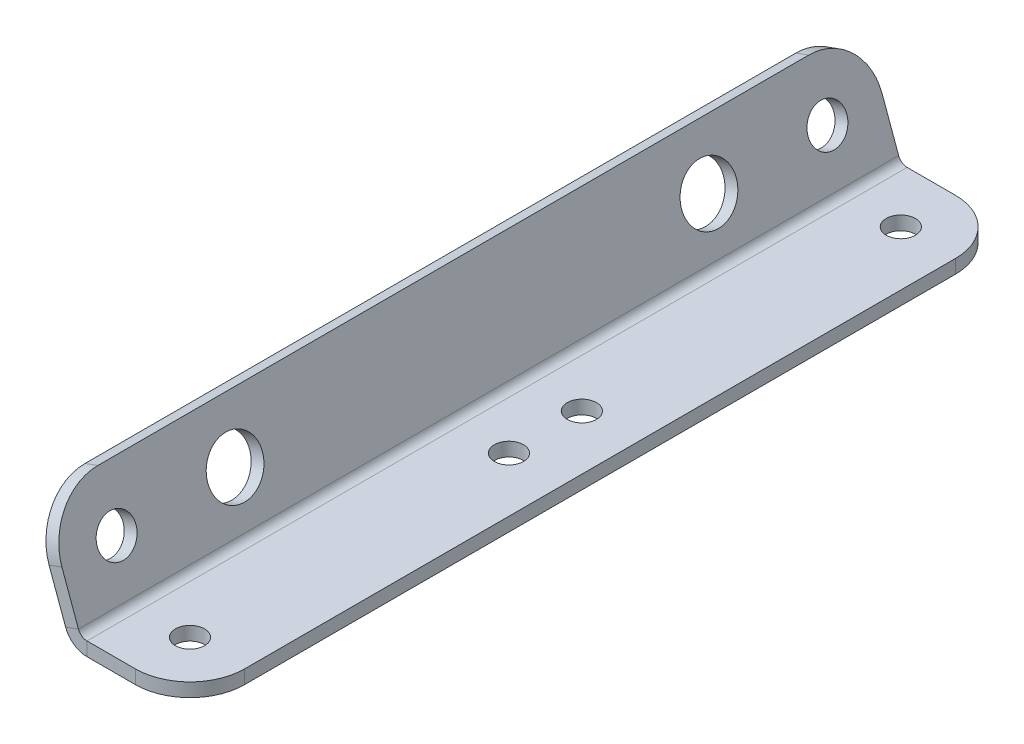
ISO-10303-21;
HEADER;
FILE_DESCRIPTION(('STEP AP214'),'2;1');
FILE_NAME('part.step','',(''),(''),'','','');
FILE_SCHEMA(('AUTOMOTIVE_DESIGN { 1 0 10303 214 1 1 1 1 }'));
ENDSEC;
DATA;
#1=APPLICATION_CONTEXT('core data for automotive mechanical design processes');
#2=APPLICATION_PROTOCOL_DEFINITION('international standard','automotive_design',2000,#1);
#3=PRODUCT_CONTEXT('',#1,'mechanical');
#4=PRODUCT('Part','Part','',(#3));
#5=PRODUCT_RELATED_PRODUCT_CATEGORY('part','',(#4));
#6=PRODUCT_DEFINITION_FORMATION('','',#4);
#7=PRODUCT_DEFINITION_CONTEXT('part definition',#1,'design');
#8=PRODUCT_DEFINITION('design','',#6,#7);
#9=PRODUCT_DEFINITION_SHAPE('','',#8);
#10=(LENGTH_UNIT() NAMED_UNIT(*) SI_UNIT(.MILLI.,.METRE.));
#11=(NAMED_UNIT(*) PLANE_ANGLE_UNIT() SI_UNIT($,.RADIAN.));
#12=(NAMED_UNIT(*) SI_UNIT($,.STERADIAN.) SOLID_ANGLE_UNIT());
#13=UNCERTAINTY_MEASURE_WITH_UNIT(LENGTH_MEASURE(1.E-05),#10,'distance_accuracy_value','');
#14=(GEOMETRIC_REPRESENTATION_CONTEXT(3) GLOBAL_UNCERTAINTY_ASSIGNED_CONTEXT((#13)) GLOBAL_UNIT_ASSIGNED_CONTEXT((#10,
#11,#12)) REPRESENTATION_CONTEXT('',''));
#15=CARTESIAN_POINT('',(0.,0.,0.));
#16=DIRECTION('',(0.,0.,1.));
#17=DIRECTION('',(1.,0.,0.));
#18=AXIS2_PLACEMENT_3D('',#15,#16,#17);
#19=CARTESIAN_POINT('',(340.945249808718,124.09392244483,-90.));
#20=DIRECTION('',(0.,0.,1.));
#21=DIRECTION('',(0.342020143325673,-0.939692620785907,0.));
#22=AXIS2_PLACEMENT_3D('',#19,#20,#21);
#23=PLANE('',#22);
#24=DIRECTION('',(-0.342020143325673,0.939692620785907,0.));
#25=VECTOR('',#24,1.);
#26=CARTESIAN_POINT('',(-2.81907786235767,-1.02606042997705,-90.));
#27=LINE('',#26,#25);
#28=CARTESIAN_POINT('',(-3.29804802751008,0.289899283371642,-90.));
#29=VERTEX_POINT('',#28);
#30=CARTESIAN_POINT('',(-6.92331958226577,10.2502510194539,-90.));
#31=VERTEX_POINT('',#30);
#32=EDGE_CURVE('E183',#29,#31,#27,.T.);
#33=ORIENTED_EDGE('',*,*,#32,.T.);
#34=DIRECTION('',(-0.939692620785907,-0.342020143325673,0.));
#35=VECTOR('',#34,1.);
#36=CARTESIAN_POINT('',(336.84100808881,135.370233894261,-90.0000000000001));
#37=LINE('',#36,#35);
#38=CARTESIAN_POINT('',(-4.10424171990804,11.2763114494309,-90.));
#39=VERTEX_POINT('',#38);
#40=EDGE_CURVE('E219',#31,#39,#37,.F.);
#41=ORIENTED_EDGE('',*,*,#40,.T.);
#42=DIRECTION('',(-0.342020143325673,0.939692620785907,0.));
#43=VECTOR('',#42,1.);
#44=CARTESIAN_POINT('',(0.,0.,-90.));
#45=LINE('',#44,#43);
#46=CARTESIAN_POINT('',(-0.478970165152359,1.31595971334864,-90.));
#47=VERTEX_POINT('',#46);
#48=EDGE_CURVE('E195',#47,#39,#45,.T.);
#49=ORIENTED_EDGE('',*,*,#48,.F.);
#50=DIRECTION('',(-0.939692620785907,-0.342020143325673,0.));
#51=VECTOR('',#50,1.);
#52=CARTESIAN_POINT('',(340.466279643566,125.409882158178,-90.));
#53=LINE('',#52,#51);
#54=EDGE_CURVE('E141',#47,#29,#53,.T.);
#55=ORIENTED_EDGE('',*,*,#54,.T.);
#56=EDGE_LOOP('',(#33,#41,#49,#55));
#57=FACE_BOUND('',#56,.T.);
#58=ADVANCED_FACE('F29',(#57),#23,.F.);
#59=CARTESIAN_POINT('',(332.736766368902,146.646545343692,90.));
#60=DIRECTION('',(-0.342020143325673,0.939692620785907,0.));
#61=DIRECTION('',(-0.939692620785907,-0.342020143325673,0.));
#62=AXIS2_PLACEMENT_3D('',#59,#60,#61);
#63=PLANE('',#62);
#64=DIRECTION('',(0.,0.,-1.));
#65=VECTOR('',#64,1.);
#66=CARTESIAN_POINT('',(-8.20848343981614,22.5526228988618,90.));
#67=LINE('',#66,#65);
#68=CARTESIAN_POINT('',(-8.20848343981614,22.5526228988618,78.));
#69=VERTEX_POINT('',#68);
#70=CARTESIAN_POINT('',(-8.20848343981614,22.5526228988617,-77.9999999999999));
#71=VERTEX_POINT('',#70);
#72=EDGE_CURVE('E198',#69,#71,#67,.T.);
#73=ORIENTED_EDGE('',*,*,#72,.T.);
#74=DIRECTION('',(-0.939692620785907,-0.342020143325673,0.));
#75=VECTOR('',#74,1.);
#76=CARTESIAN_POINT('',(332.736766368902,146.646545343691,-78.0000000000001));
#77=LINE('',#76,#75);
#78=CARTESIAN_POINT('',(-11.0275613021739,21.5265624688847,-77.9999999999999));
#79=VERTEX_POINT('',#78);
#80=EDGE_CURVE('E212',#71,#79,#77,.T.);
#81=ORIENTED_EDGE('',*,*,#80,.T.);
#82=DIRECTION('',(0.,0.,-1.));
#83=VECTOR('',#82,1.);
#84=CARTESIAN_POINT('',(-11.0275613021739,21.5265624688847,90.));
#85=LINE('',#84,#83);
#86=CARTESIAN_POINT('',(-11.0275613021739,21.5265624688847,78.));
#87=VERTEX_POINT('',#86);
#88=EDGE_CURVE('E189',#87,#79,#85,.T.);
#89=ORIENTED_EDGE('',*,*,#88,.F.);
#90=DIRECTION('',(-0.939692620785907,-0.342020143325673,0.));
#91=VECTOR('',#90,1.);
#92=CARTESIAN_POINT('',(332.736766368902,146.646545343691,78.));
#93=LINE('',#92,#91);
#94=EDGE_CURVE('E210',#87,#69,#93,.F.);
#95=ORIENTED_EDGE('',*,*,#94,.T.);
#96=EDGE_LOOP('',(#73,#81,#89,#95));
#97=FACE_BOUND('',#96,.T.);
#98=ADVANCED_FACE('F323',(#97),#63,.T.);
#99=CARTESIAN_POINT('',(340.945249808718,124.09392244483,90.));
#100=DIRECTION('',(0.,0.,1.));
#101=DIRECTION('',(0.342020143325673,-0.939692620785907,0.));
#102=AXIS2_PLACEMENT_3D('',#99,#100,#101);
#103=PLANE('',#102);
#104=DIRECTION('',(-0.342020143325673,0.939692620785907,0.));
#105=VECTOR('',#104,1.);
#106=CARTESIAN_POINT('',(0.,0.,90.));
#107=LINE('',#106,#105);
#108=CARTESIAN_POINT('',(-0.478970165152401,1.31595971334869,90.));
#109=VERTEX_POINT('',#108);
#110=CARTESIAN_POINT('',(-4.10424171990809,11.2763114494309,90.));
#111=VERTEX_POINT('',#110);
#112=EDGE_CURVE('E201',#109,#111,#107,.T.);
#113=ORIENTED_EDGE('',*,*,#112,.T.);
#114=DIRECTION('',(-0.939692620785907,-0.342020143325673,0.));
#115=VECTOR('',#114,1.);
#116=CARTESIAN_POINT('',(336.84100808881,135.370233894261,90.));
#117=LINE('',#116,#115);
#118=CARTESIAN_POINT('',(-6.92331958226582,10.2502510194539,90.));
#119=VERTEX_POINT('',#118);
#120=EDGE_CURVE('E11',#111,#119,#117,.T.);
#121=ORIENTED_EDGE('',*,*,#120,.T.);
#122=DIRECTION('',(-0.342020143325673,0.939692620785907,0.));
#123=VECTOR('',#122,1.);
#124=CARTESIAN_POINT('',(-2.81907786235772,-1.02606042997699,90.));
#125=LINE('',#124,#123);
#126=CARTESIAN_POINT('',(-3.29804802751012,0.289899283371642,90.));
#127=VERTEX_POINT('',#126);
#128=EDGE_CURVE('E186',#127,#119,#125,.T.);
#129=ORIENTED_EDGE('',*,*,#128,.F.);
#130=DIRECTION('',(-0.939692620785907,-0.342020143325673,0.));
#131=VECTOR('',#130,1.);
#132=CARTESIAN_POINT('',(340.466279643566,125.409882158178,90.));
#133=LINE('',#132,#131);
#134=EDGE_CURVE('E207',#109,#127,#133,.T.);
#135=ORIENTED_EDGE('',*,*,#134,.F.);
#136=EDGE_LOOP('',(#113,#121,#129,#135));
#137=FACE_BOUND('',#136,.T.);
#138=ADVANCED_FACE('F328',(#137),#103,.T.);
#139=CARTESIAN_POINT('',(0.,0.,90.));
#140=DIRECTION('',(-0.939692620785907,-0.342020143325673,0.));
#141=DIRECTION('',(0.342020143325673,-0.939692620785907,0.));
#142=AXIS2_PLACEMENT_3D('',#139,#140,#141);
#143=PLANE('',#142);
#144=CARTESIAN_POINT('',(-4.10424171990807,11.2763114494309,-52.));
#145=DIRECTION('',(0.939692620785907,0.342020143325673,0.));
#146=DIRECTION('',(0.342020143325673,-0.939692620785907,0.));
#147=AXIS2_PLACEMENT_3D('',#144,#145,#146);
#148=CIRCLE('',#147,6.);
#149=CARTESIAN_POINT('',(-2.05212085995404,5.63815572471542,-52.));
#150=VERTEX_POINT('',#149);
#151=EDGE_CURVE('E155',#150,#150,#148,.T.);
#152=ORIENTED_EDGE('',*,*,#151,.F.);
#153=EDGE_LOOP('',(#152));
#154=FACE_BOUND('',#153,.T.);
#155=CARTESIAN_POINT('',(-4.10424171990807,11.2763114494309,-78.));
#156=DIRECTION('',(0.939692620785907,0.342020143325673,0.));
#157=DIRECTION('',(0.342020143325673,-0.939692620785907,0.));
#158=AXIS2_PLACEMENT_3D('',#155,#156,#157);
#159=CIRCLE('',#158,4.25);
#160=CARTESIAN_POINT('',(-2.65065611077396,7.28261781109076,-78.));
#161=VERTEX_POINT('',#160);
#162=EDGE_CURVE('E165',#161,#161,#159,.T.);
#163=ORIENTED_EDGE('',*,*,#162,.F.);
#164=EDGE_LOOP('',(#163));
#165=FACE_BOUND('',#164,.T.);
#166=CARTESIAN_POINT('',(-4.10424171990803,11.2763114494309,52.));
#167=DIRECTION('',(0.939692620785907,0.342020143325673,0.));
#168=DIRECTION('',(-0.342020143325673,0.939692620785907,0.));
#169=AXIS2_PLACEMENT_3D('',#166,#167,#168);
#170=CIRCLE('',#169,6.);
#171=CARTESIAN_POINT('',(-6.15636257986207,16.9144671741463,52.));
#172=VERTEX_POINT('',#171);
#173=EDGE_CURVE('E171',#172,#172,#170,.T.);
#174=ORIENTED_EDGE('',*,*,#173,.F.);
#175=EDGE_LOOP('',(#174));
#176=FACE_BOUND('',#175,.T.);
#177=CARTESIAN_POINT('',(-4.10424171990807,11.2763114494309,78.));
#178=DIRECTION('',(0.939692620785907,0.342020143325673,0.));
#179=DIRECTION('',(-0.342020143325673,0.939692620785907,0.));
#180=AXIS2_PLACEMENT_3D('',#177,#178,#179);
#181=CIRCLE('',#180,4.25);
#182=CARTESIAN_POINT('',(-5.55782732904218,15.270005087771,78.));
#183=VERTEX_POINT('',#182);
#184=EDGE_CURVE('E177',#183,#183,#181,.T.);
#185=ORIENTED_EDGE('',*,*,#184,.F.);
#186=EDGE_LOOP('',(#185));
#187=FACE_BOUND('',#186,.T.);
#188=ORIENTED_EDGE('',*,*,#48,.T.);
#189=CARTESIAN_POINT('',(-4.10424171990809,11.2763114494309,-78.));
#190=DIRECTION('',(-0.939692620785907,-0.342020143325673,0.));
#191=DIRECTION('',(0.342020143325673,-0.939692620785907,0.));
#192=AXIS2_PLACEMENT_3D('',#189,#190,#191);
#193=CIRCLE('',#192,12.);
#194=EDGE_CURVE('E223',#39,#71,#193,.F.);
#195=ORIENTED_EDGE('',*,*,#194,.T.);
#196=ORIENTED_EDGE('',*,*,#72,.F.);
#197=CARTESIAN_POINT('',(-4.10424171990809,11.2763114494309,78.));
#198=DIRECTION('',(-0.939692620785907,-0.342020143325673,0.));
#199=DIRECTION('',(0.342020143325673,-0.939692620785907,0.));
#200=AXIS2_PLACEMENT_3D('',#197,#198,#199);
#201=CIRCLE('',#200,12.);
#202=EDGE_CURVE('E221',#69,#111,#201,.F.);
#203=ORIENTED_EDGE('',*,*,#202,.T.);
#204=ORIENTED_EDGE('',*,*,#112,.F.);
#205=DIRECTION('',(0.,0.,-1.));
#206=VECTOR('',#205,1.);
#207=CARTESIAN_POINT('',(-0.478970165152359,1.31595971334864,-90.));
#208=LINE('',#207,#206);
#209=EDGE_CURVE('E204',#109,#47,#208,.T.);
#210=ORIENTED_EDGE('',*,*,#209,.T.);
#211=EDGE_LOOP('',(#188,#195,#196,#203,#204,#210));
#212=FACE_BOUND('',#211,.T.);
#213=ADVANCED_FACE('F339',(#154,#165,#176,#187,#212),#143,.F.);
#214=CARTESIAN_POINT('',(-2.81907786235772,-1.02606042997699,90.));
#215=DIRECTION('',(-0.939692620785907,-0.342020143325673,0.));
#216=DIRECTION('',(0.342020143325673,-0.939692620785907,0.));
#217=AXIS2_PLACEMENT_3D('',#214,#215,#216);
#218=PLANE('',#217);
#219=CARTESIAN_POINT('',(-6.92331958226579,10.2502510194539,-52.));
#220=DIRECTION('',(0.939692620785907,0.342020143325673,0.));
#221=DIRECTION('',(0.342020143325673,-0.939692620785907,0.));
#222=AXIS2_PLACEMENT_3D('',#219,#220,#221);
#223=CIRCLE('',#222,6.);
#224=CARTESIAN_POINT('',(-4.87119872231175,4.61209529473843,-52.));
#225=VERTEX_POINT('',#224);
#226=EDGE_CURVE('E158',#225,#225,#223,.T.);
#227=ORIENTED_EDGE('',*,*,#226,.T.);
#228=EDGE_LOOP('',(#227));
#229=FACE_BOUND('',#228,.T.);
#230=CARTESIAN_POINT('',(-6.92331958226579,10.2502510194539,-78.));
#231=DIRECTION('',(0.939692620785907,0.342020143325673,0.));
#232=DIRECTION('',(0.342020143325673,-0.939692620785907,0.));
#233=AXIS2_PLACEMENT_3D('',#230,#231,#232);
#234=CIRCLE('',#233,4.25);
#235=CARTESIAN_POINT('',(-5.46973397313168,6.25655738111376,-78.));
#236=VERTEX_POINT('',#235);
#237=EDGE_CURVE('E168',#236,#236,#234,.T.);
#238=ORIENTED_EDGE('',*,*,#237,.T.);
#239=EDGE_LOOP('',(#238));
#240=FACE_BOUND('',#239,.T.);
#241=CARTESIAN_POINT('',(-6.92331958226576,10.2502510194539,52.));
#242=DIRECTION('',(0.939692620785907,0.342020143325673,0.));
#243=DIRECTION('',(-0.342020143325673,0.939692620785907,0.));
#244=AXIS2_PLACEMENT_3D('',#241,#242,#243);
#245=CIRCLE('',#244,6.);
#246=CARTESIAN_POINT('',(-8.9754404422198,15.8884067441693,52.));
#247=VERTEX_POINT('',#246);
#248=EDGE_CURVE('E174',#247,#247,#245,.T.);
#249=ORIENTED_EDGE('',*,*,#248,.T.);
#250=EDGE_LOOP('',(#249));
#251=FACE_BOUND('',#250,.T.);
#252=CARTESIAN_POINT('',(-6.9233195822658,10.2502510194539,78.));
#253=DIRECTION('',(0.939692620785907,0.342020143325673,0.));
#254=DIRECTION('',(-0.342020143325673,0.939692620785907,0.));
#255=AXIS2_PLACEMENT_3D('',#252,#253,#254);
#256=CIRCLE('',#255,4.25);
#257=CARTESIAN_POINT('',(-8.37690519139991,14.243944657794,78.));
#258=VERTEX_POINT('',#257);
#259=EDGE_CURVE('E180',#258,#258,#256,.T.);
#260=ORIENTED_EDGE('',*,*,#259,.T.);
#261=EDGE_LOOP('',(#260));
#262=FACE_BOUND('',#261,.T.);
#263=ORIENTED_EDGE('',*,*,#88,.T.);
#264=CARTESIAN_POINT('',(-6.92331958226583,10.2502510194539,-78.));
#265=DIRECTION('',(-0.939692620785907,-0.342020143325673,0.));
#266=DIRECTION('',(0.342020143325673,-0.939692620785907,0.));
#267=AXIS2_PLACEMENT_3D('',#264,#265,#266);
#268=CIRCLE('',#267,12.);
#269=EDGE_CURVE('E217',#79,#31,#268,.T.);
#270=ORIENTED_EDGE('',*,*,#269,.T.);
#271=ORIENTED_EDGE('',*,*,#32,.F.);
#272=DIRECTION('',(0.,0.,-1.));
#273=VECTOR('',#272,1.);
#274=CARTESIAN_POINT('',(-3.29804802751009,0.289899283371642,-90.));
#275=LINE('',#274,#273);
#276=EDGE_CURVE('E192',#127,#29,#275,.T.);
#277=ORIENTED_EDGE('',*,*,#276,.F.);
#278=ORIENTED_EDGE('',*,*,#128,.T.);
#279=CARTESIAN_POINT('',(-6.92331958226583,10.2502510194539,78.));
#280=DIRECTION('',(-0.939692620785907,-0.342020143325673,0.));
#281=DIRECTION('',(0.342020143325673,-0.939692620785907,0.));
#282=AXIS2_PLACEMENT_3D('',#279,#280,#281);
#283=CIRCLE('',#282,12.);
#284=EDGE_CURVE('E215',#119,#87,#283,.T.);
#285=ORIENTED_EDGE('',*,*,#284,.T.);
#286=EDGE_LOOP('',(#263,#270,#271,#277,#278,#285));
#287=FACE_BOUND('',#286,.T.);
#288=ADVANCED_FACE('F349',(#229,#240,#251,#262,#287),#218,.T.);
#289=CARTESIAN_POINT('',(-6.9233195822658,10.2502510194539,78.));
#290=DIRECTION('',(0.939692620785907,0.342020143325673,0.));
#291=DIRECTION('',(-0.342020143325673,0.939692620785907,0.));
#292=AXIS2_PLACEMENT_3D('',#289,#290,#291);
#293=CYLINDRICAL_SURFACE('',#292,4.25);
#294=ORIENTED_EDGE('',*,*,#259,.F.);
#295=EDGE_LOOP('',(#294));
#296=FACE_BOUND('',#295,.T.);
#297=ORIENTED_EDGE('',*,*,#184,.T.);
#298=EDGE_LOOP('',(#297));
#299=FACE_BOUND('',#298,.T.);
#300=ADVANCED_FACE('F351',(#296,#299),#293,.F.);
#301=CARTESIAN_POINT('',(-6.92331958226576,10.2502510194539,52.));
#302=DIRECTION('',(0.939692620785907,0.342020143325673,0.));
#303=DIRECTION('',(-0.342020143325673,0.939692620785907,0.));
#304=AXIS2_PLACEMENT_3D('',#301,#302,#303);
#305=CYLINDRICAL_SURFACE('',#304,6.);
#306=ORIENTED_EDGE('',*,*,#248,.F.);
#307=EDGE_LOOP('',(#306));
#308=FACE_BOUND('',#307,.T.);
#309=ORIENTED_EDGE('',*,*,#173,.T.);
#310=EDGE_LOOP('',(#309));
#311=FACE_BOUND('',#310,.T.);
#312=ADVANCED_FACE('F358',(#308,#311),#305,.F.);
#313=CARTESIAN_POINT('',(-6.92331958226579,10.2502510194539,-78.));
#314=DIRECTION('',(0.939692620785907,0.342020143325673,0.));
#315=DIRECTION('',(-0.342020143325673,0.939692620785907,0.));
#316=AXIS2_PLACEMENT_3D('',#313,#314,#315);
#317=CYLINDRICAL_SURFACE('',#316,4.25);
#318=ORIENTED_EDGE('',*,*,#237,.F.);
#319=EDGE_LOOP('',(#318));
#320=FACE_BOUND('',#319,.T.);
#321=ORIENTED_EDGE('',*,*,#162,.T.);
#322=EDGE_LOOP('',(#321));
#323=FACE_BOUND('',#322,.T.);
#324=ADVANCED_FACE('F394',(#320,#323),#317,.F.);
#325=CARTESIAN_POINT('',(-6.92331958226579,10.2502510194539,-52.));
#326=DIRECTION('',(0.939692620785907,0.342020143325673,0.));
#327=DIRECTION('',(-0.342020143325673,0.939692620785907,0.));
#328=AXIS2_PLACEMENT_3D('',#325,#326,#327);
#329=CYLINDRICAL_SURFACE('',#328,6.);
#330=ORIENTED_EDGE('',*,*,#226,.F.);
#331=EDGE_LOOP('',(#330));
#332=FACE_BOUND('',#331,.T.);
#333=ORIENTED_EDGE('',*,*,#151,.T.);
#334=EDGE_LOOP('',(#333));
#335=FACE_BOUND('',#334,.T.);
#336=ADVANCED_FACE('F403',(#332,#335),#329,.F.);
#337=CARTESIAN_POINT('',(0.,362.826356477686,-89.9999999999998));
#338=DIRECTION('',(0.,0.,1.));
#339=DIRECTION('',(1.,0.,0.));
#340=AXIS2_PLACEMENT_3D('',#337,#338,#339);
#341=PLANE('',#340);
#342=DIRECTION('',(-1.,0.,0.));
#343=VECTOR('',#342,1.);
#344=CARTESIAN_POINT('',(0.,0.,-90.));
#345=LINE('',#344,#343);
#346=CARTESIAN_POINT('',(12.,0.,-89.9999999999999));
#347=VERTEX_POINT('',#346);
#348=CARTESIAN_POINT('',(1.40041507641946,0.,-90.));
#349=VERTEX_POINT('',#348);
#350=EDGE_CURVE('E119',#347,#349,#345,.T.);
#351=ORIENTED_EDGE('',*,*,#350,.F.);
#352=DIRECTION('',(0.,-1.,0.));
#353=VECTOR('',#352,1.);
#354=CARTESIAN_POINT('',(12.0000000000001,362.826356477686,-89.9999999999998));
#355=LINE('',#354,#353);
#356=CARTESIAN_POINT('',(12.,-3.00000000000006,-90.));
#357=VERTEX_POINT('',#356);
#358=EDGE_CURVE('E225',#347,#357,#355,.T.);
#359=ORIENTED_EDGE('',*,*,#358,.T.);
#360=DIRECTION('',(1.,0.,0.));
#361=VECTOR('',#360,1.);
#362=CARTESIAN_POINT('',(0.,-3.00000000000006,-90.0000000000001));
#363=LINE('',#362,#361);
#364=CARTESIAN_POINT('',(1.40041507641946,-3.00000000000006,-90.0000000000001));
#365=VERTEX_POINT('',#364);
#366=EDGE_CURVE('E154',#357,#365,#363,.F.);
#367=ORIENTED_EDGE('',*,*,#366,.T.);
#368=DIRECTION('',(0.,-1.,0.));
#369=VECTOR('',#368,1.);
#370=CARTESIAN_POINT('',(1.40041507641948,362.826356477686,-89.9999999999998));
#371=LINE('',#370,#369);
#372=EDGE_CURVE('E138',#349,#365,#371,.T.);
#373=ORIENTED_EDGE('',*,*,#372,.F.);
#374=EDGE_LOOP('',(#351,#359,#367,#373));
#375=FACE_BOUND('',#374,.T.);
#376=ADVANCED_FACE('F152',(#375),#341,.F.);
#377=CARTESIAN_POINT('',(0.,362.826356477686,90.0000000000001));
#378=DIRECTION('',(0.,0.,1.));
#379=DIRECTION('',(1.,0.,0.));
#380=AXIS2_PLACEMENT_3D('',#377,#378,#379);
#381=PLANE('',#380);
#382=DIRECTION('',(1.,0.,0.));
#383=VECTOR('',#382,1.);
#384=CARTESIAN_POINT('',(0.,-2.99999999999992,90.));
#385=LINE('',#384,#383);
#386=CARTESIAN_POINT('',(12.,-2.99999999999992,90.));
#387=VERTEX_POINT('',#386);
#388=CARTESIAN_POINT('',(1.40041507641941,-2.99999999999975,90.));
#389=VERTEX_POINT('',#388);
#390=EDGE_CURVE('E247',#387,#389,#385,.F.);
#391=ORIENTED_EDGE('',*,*,#390,.F.);
#392=DIRECTION('',(0.,-1.,0.));
#393=VECTOR('',#392,1.);
#394=CARTESIAN_POINT('',(12.0000000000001,362.826356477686,90.0000000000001));
#395=LINE('',#394,#393);
#396=CARTESIAN_POINT('',(12.,0.,90.));
#397=VERTEX_POINT('',#396);
#398=EDGE_CURVE('E36',#387,#397,#395,.F.);
#399=ORIENTED_EDGE('',*,*,#398,.T.);
#400=DIRECTION('',(-1.,0.,0.));
#401=VECTOR('',#400,1.);
#402=CARTESIAN_POINT('',(0.,0.,90.));
#403=LINE('',#402,#401);
#404=CARTESIAN_POINT('',(1.40041507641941,0.,90.));
#405=VERTEX_POINT('',#404);
#406=EDGE_CURVE('E130',#397,#405,#403,.T.);
#407=ORIENTED_EDGE('',*,*,#406,.T.);
#408=DIRECTION('',(0.,-1.,0.));
#409=VECTOR('',#408,1.);
#410=CARTESIAN_POINT('',(1.4004150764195,362.826356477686,90.0000000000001));
#411=LINE('',#410,#409);
#412=EDGE_CURVE('E149',#405,#389,#411,.T.);
#413=ORIENTED_EDGE('',*,*,#412,.T.);
#414=EDGE_LOOP('',(#391,#399,#407,#413));
#415=FACE_BOUND('',#414,.T.);
#416=ADVANCED_FACE('F250',(#415),#381,.T.);
#417=CARTESIAN_POINT('',(24.0000000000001,362.826356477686,90.0000000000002));
#418=DIRECTION('',(-1.,0.,0.));
#419=DIRECTION('',(0.,0.,1.));
#420=AXIS2_PLACEMENT_3D('',#417,#418,#419);
#421=PLANE('',#420);
#422=DIRECTION('',(0.,0.,-1.));
#423=VECTOR('',#422,1.);
#424=CARTESIAN_POINT('',(24.,-2.99999999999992,90.));
#425=LINE('',#424,#423);
#426=CARTESIAN_POINT('',(24.,-2.99999999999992,78.));
#427=VERTEX_POINT('',#426);
#428=CARTESIAN_POINT('',(24.,-3.,-77.9999999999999));
#429=VERTEX_POINT('',#428);
#430=EDGE_CURVE('E249',#427,#429,#425,.T.);
#431=ORIENTED_EDGE('',*,*,#430,.T.);
#432=DIRECTION('',(0.,-1.,0.));
#433=VECTOR('',#432,1.);
#434=CARTESIAN_POINT('',(24.0000000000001,362.826356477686,-77.9999999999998));
#435=LINE('',#434,#433);
#436=CARTESIAN_POINT('',(24.,0.,-77.9999999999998));
#437=VERTEX_POINT('',#436);
#438=EDGE_CURVE('E50',#429,#437,#435,.F.);
#439=ORIENTED_EDGE('',*,*,#438,.T.);
#440=DIRECTION('',(0.,0.,-1.));
#441=VECTOR('',#440,1.);
#442=CARTESIAN_POINT('',(24.,0.,90.));
#443=LINE('',#442,#441);
#444=CARTESIAN_POINT('',(24.,0.,78.));
#445=VERTEX_POINT('',#444);
#446=EDGE_CURVE('E150',#445,#437,#443,.T.);
#447=ORIENTED_EDGE('',*,*,#446,.F.);
#448=DIRECTION('',(0.,-1.,0.));
#449=VECTOR('',#448,1.);
#450=CARTESIAN_POINT('',(24.0000000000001,362.826356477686,78.0000000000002));
#451=LINE('',#450,#449);
#452=EDGE_CURVE('E231',#445,#427,#451,.T.);
#453=ORIENTED_EDGE('',*,*,#452,.T.);
#454=EDGE_LOOP('',(#431,#439,#447,#453));
#455=FACE_BOUND('',#454,.T.);
#456=ADVANCED_FACE('F240',(#455),#421,.F.);
#457=CARTESIAN_POINT('',(0.,0.,90.));
#458=DIRECTION('',(0.,-1.,0.));
#459=DIRECTION('',(0.,0.,-1.));
#460=AXIS2_PLACEMENT_3D('',#457,#458,#459);
#461=PLANE('',#460);
#462=CARTESIAN_POINT('',(12.,0.,-7.99999999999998));
#463=DIRECTION('',(0.,1.,0.));
#464=DIRECTION('',(1.,0.,0.));
#465=AXIS2_PLACEMENT_3D('',#462,#463,#464);
#466=CIRCLE('',#465,3.2);
#467=CARTESIAN_POINT('',(15.2,0.,-7.99999999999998));
#468=VERTEX_POINT('',#467);
#469=EDGE_CURVE('E265',#468,#468,#466,.T.);
#470=ORIENTED_EDGE('',*,*,#469,.F.);
#471=EDGE_LOOP('',(#470));
#472=FACE_BOUND('',#471,.T.);
#473=CARTESIAN_POINT('',(12.,0.,-77.9999999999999));
#474=DIRECTION('',(0.,1.,0.));
#475=DIRECTION('',(1.,0.,0.));
#476=AXIS2_PLACEMENT_3D('',#473,#474,#475);
#477=CIRCLE('',#476,3.2);
#478=CARTESIAN_POINT('',(15.2,0.,-77.9999999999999));
#479=VERTEX_POINT('',#478);
#480=EDGE_CURVE('E285',#479,#479,#477,.T.);
#481=ORIENTED_EDGE('',*,*,#480,.F.);
#482=EDGE_LOOP('',(#481));
#483=FACE_BOUND('',#482,.T.);
#484=CARTESIAN_POINT('',(12.,0.,7.99999999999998));
#485=DIRECTION('',(0.,1.,0.));
#486=DIRECTION('',(-1.,0.,0.));
#487=AXIS2_PLACEMENT_3D('',#484,#485,#486);
#488=CIRCLE('',#487,3.2);
#489=CARTESIAN_POINT('',(8.8,0.,7.99999999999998));
#490=VERTEX_POINT('',#489);
#491=EDGE_CURVE('E279',#490,#490,#488,.T.);
#492=ORIENTED_EDGE('',*,*,#491,.F.);
#493=EDGE_LOOP('',(#492));
#494=FACE_BOUND('',#493,.T.);
#495=CARTESIAN_POINT('',(12.,0.,78.));
#496=DIRECTION('',(0.,1.,0.));
#497=DIRECTION('',(-1.,0.,0.));
#498=AXIS2_PLACEMENT_3D('',#495,#496,#497);
#499=CIRCLE('',#498,3.2);
#500=CARTESIAN_POINT('',(8.8,0.,78.));
#501=VERTEX_POINT('',#500);
#502=EDGE_CURVE('E271',#501,#501,#499,.T.);
#503=ORIENTED_EDGE('',*,*,#502,.F.);
#504=EDGE_LOOP('',(#503));
#505=FACE_BOUND('',#504,.T.);
#506=ORIENTED_EDGE('',*,*,#446,.T.);
#507=CARTESIAN_POINT('',(12.,0.,-77.9999999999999));
#508=DIRECTION('',(0.,-1.,0.));
#509=DIRECTION('',(0.,0.,-1.));
#510=AXIS2_PLACEMENT_3D('',#507,#508,#509);
#511=CIRCLE('',#510,12.);
#512=EDGE_CURVE('E125',#437,#347,#511,.F.);
#513=ORIENTED_EDGE('',*,*,#512,.T.);
#514=ORIENTED_EDGE('',*,*,#350,.T.);
#515=DIRECTION('',(0.,0.,-1.));
#516=VECTOR('',#515,1.);
#517=CARTESIAN_POINT('',(1.40041507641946,0.,-90.));
#518=LINE('',#517,#516);
#519=EDGE_CURVE('E123',#405,#349,#518,.T.);
#520=ORIENTED_EDGE('',*,*,#519,.F.);
#521=ORIENTED_EDGE('',*,*,#406,.F.);
#522=CARTESIAN_POINT('',(12.,0.,78.));
#523=DIRECTION('',(0.,-1.,0.));
#524=DIRECTION('',(0.,0.,-1.));
#525=AXIS2_PLACEMENT_3D('',#522,#523,#524);
#526=CIRCLE('',#525,12.);
#527=EDGE_CURVE('E235',#397,#445,#526,.F.);
#528=ORIENTED_EDGE('',*,*,#527,.T.);
#529=EDGE_LOOP('',(#506,#513,#514,#520,#521,#528));
#530=FACE_BOUND('',#529,.T.);
#531=ADVANCED_FACE('F121',(#472,#483,#494,#505,#530),#461,.F.);
#532=CARTESIAN_POINT('',(0.,-2.99999999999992,90.));
#533=DIRECTION('',(0.,-1.,0.));
#534=DIRECTION('',(0.,0.,-1.));
#535=AXIS2_PLACEMENT_3D('',#532,#533,#534);
#536=PLANE('',#535);
#537=CARTESIAN_POINT('',(12.,-3.,-7.99999999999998));
#538=DIRECTION('',(0.,1.,0.));
#539=DIRECTION('',(1.,0.,0.));
#540=AXIS2_PLACEMENT_3D('',#537,#538,#539);
#541=CIRCLE('',#540,3.2);
#542=CARTESIAN_POINT('',(15.2,-3.,-7.99999999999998));
#543=VERTEX_POINT('',#542);
#544=EDGE_CURVE('E288',#543,#543,#541,.T.);
#545=ORIENTED_EDGE('',*,*,#544,.T.);
#546=EDGE_LOOP('',(#545));
#547=FACE_BOUND('',#546,.T.);
#548=CARTESIAN_POINT('',(12.,-3.,-78.));
#549=DIRECTION('',(0.,1.,0.));
#550=DIRECTION('',(1.,0.,0.));
#551=AXIS2_PLACEMENT_3D('',#548,#549,#550);
#552=CIRCLE('',#551,3.2);
#553=CARTESIAN_POINT('',(15.2,-3.,-78.));
#554=VERTEX_POINT('',#553);
#555=EDGE_CURVE('E282',#554,#554,#552,.T.);
#556=ORIENTED_EDGE('',*,*,#555,.T.);
#557=EDGE_LOOP('',(#556));
#558=FACE_BOUND('',#557,.T.);
#559=CARTESIAN_POINT('',(12.,-3.,7.99999999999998));
#560=DIRECTION('',(0.,1.,0.));
#561=DIRECTION('',(-1.,0.,0.));
#562=AXIS2_PLACEMENT_3D('',#559,#560,#561);
#563=CIRCLE('',#562,3.2);
#564=CARTESIAN_POINT('',(8.8,-3.,7.99999999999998));
#565=VERTEX_POINT('',#564);
#566=EDGE_CURVE('E276',#565,#565,#563,.T.);
#567=ORIENTED_EDGE('',*,*,#566,.T.);
#568=EDGE_LOOP('',(#567));
#569=FACE_BOUND('',#568,.T.);
#570=CARTESIAN_POINT('',(12.,-3.,78.));
#571=DIRECTION('',(0.,1.,0.));
#572=DIRECTION('',(-1.,0.,0.));
#573=AXIS2_PLACEMENT_3D('',#570,#571,#572);
#574=CIRCLE('',#573,3.2);
#575=CARTESIAN_POINT('',(8.8,-3.,78.));
#576=VERTEX_POINT('',#575);
#577=EDGE_CURVE('E269',#576,#576,#574,.T.);
#578=ORIENTED_EDGE('',*,*,#577,.T.);
#579=EDGE_LOOP('',(#578));
#580=FACE_BOUND('',#579,.T.);
#581=ORIENTED_EDGE('',*,*,#366,.F.);
#582=CARTESIAN_POINT('',(12.,-3.,-78.));
#583=DIRECTION('',(0.,-1.,0.));
#584=DIRECTION('',(0.,0.,-1.));
#585=AXIS2_PLACEMENT_3D('',#582,#583,#584);
#586=CIRCLE('',#585,12.);
#587=EDGE_CURVE('E229',#357,#429,#586,.T.);
#588=ORIENTED_EDGE('',*,*,#587,.T.);
#589=ORIENTED_EDGE('',*,*,#430,.F.);
#590=CARTESIAN_POINT('',(12.,-3.,78.));
#591=DIRECTION('',(0.,-1.,0.));
#592=DIRECTION('',(0.,0.,-1.));
#593=AXIS2_PLACEMENT_3D('',#590,#591,#592);
#594=CIRCLE('',#593,12.);
#595=EDGE_CURVE('E227',#427,#387,#594,.T.);
#596=ORIENTED_EDGE('',*,*,#595,.T.);
#597=ORIENTED_EDGE('',*,*,#390,.T.);
#598=DIRECTION('',(0.,0.,-1.));
#599=VECTOR('',#598,1.);
#600=CARTESIAN_POINT('',(1.40041507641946,-3.00000000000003,-90.0000000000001));
#601=LINE('',#600,#599);
#602=EDGE_CURVE('E131',#389,#365,#601,.T.);
#603=ORIENTED_EDGE('',*,*,#602,.T.);
#604=EDGE_LOOP('',(#581,#588,#589,#596,#597,#603));
#605=FACE_BOUND('',#604,.T.);
#606=ADVANCED_FACE('F245',(#547,#558,#569,#580,#605),#536,.T.);
#607=CARTESIAN_POINT('',(12.,-3.,78.));
#608=DIRECTION('',(0.,1.,0.));
#609=DIRECTION('',(-1.,0.,0.));
#610=AXIS2_PLACEMENT_3D('',#607,#608,#609);
#611=CYLINDRICAL_SURFACE('',#610,3.2);
#612=ORIENTED_EDGE('',*,*,#577,.F.);
#613=EDGE_LOOP('',(#612));
#614=FACE_BOUND('',#613,.T.);
#615=ORIENTED_EDGE('',*,*,#502,.T.);
#616=EDGE_LOOP('',(#615));
#617=FACE_BOUND('',#616,.T.);
#618=ADVANCED_FACE('F307',(#614,#617),#611,.F.);
#619=CARTESIAN_POINT('',(12.,-3.,7.99999999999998));
#620=DIRECTION('',(0.,1.,0.));
#621=DIRECTION('',(-1.,0.,0.));
#622=AXIS2_PLACEMENT_3D('',#619,#620,#621);
#623=CYLINDRICAL_SURFACE('',#622,3.2);
#624=ORIENTED_EDGE('',*,*,#566,.F.);
#625=EDGE_LOOP('',(#624));
#626=FACE_BOUND('',#625,.T.);
#627=ORIENTED_EDGE('',*,*,#491,.T.);
#628=EDGE_LOOP('',(#627));
#629=FACE_BOUND('',#628,.T.);
#630=ADVANCED_FACE('F309',(#626,#629),#623,.F.);
#631=CARTESIAN_POINT('',(12.,-3.,-78.));
#632=DIRECTION('',(0.,1.,0.));
#633=DIRECTION('',(-1.,0.,0.));
#634=AXIS2_PLACEMENT_3D('',#631,#632,#633);
#635=CYLINDRICAL_SURFACE('',#634,3.2);
#636=ORIENTED_EDGE('',*,*,#555,.F.);
#637=EDGE_LOOP('',(#636));
#638=FACE_BOUND('',#637,.T.);
#639=ORIENTED_EDGE('',*,*,#480,.T.);
#640=EDGE_LOOP('',(#639));
#641=FACE_BOUND('',#640,.T.);
#642=ADVANCED_FACE('F316',(#638,#641),#635,.F.);
#643=CARTESIAN_POINT('',(12.,-3.,-7.99999999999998));
#644=DIRECTION('',(0.,1.,0.));
#645=DIRECTION('',(-1.,0.,0.));
#646=AXIS2_PLACEMENT_3D('',#643,#644,#645);
#647=CYLINDRICAL_SURFACE('',#646,3.2);
#648=ORIENTED_EDGE('',*,*,#544,.F.);
#649=EDGE_LOOP('',(#648));
#650=FACE_BOUND('',#649,.T.);
#651=ORIENTED_EDGE('',*,*,#469,.T.);
#652=EDGE_LOOP('',(#651));
#653=FACE_BOUND('',#652,.T.);
#654=ADVANCED_FACE('F296',(#650,#653),#647,.F.);
#655=CARTESIAN_POINT('',(1.40041507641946,2.,-90.));
#656=DIRECTION('',(0.,0.,-1.));
#657=DIRECTION('',(-1.,0.,0.));
#658=AXIS2_PLACEMENT_3D('',#655,#656,#657);
#659=PLANE('',#658);
#660=ORIENTED_EDGE('',*,*,#54,.F.);
#661=CARTESIAN_POINT('',(1.40041507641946,2.,-90.));
#662=DIRECTION('',(0.,0.,1.));
#663=DIRECTION('',(1.,0.,0.));
#664=AXIS2_PLACEMENT_3D('',#661,#662,#663);
#665=CIRCLE('',#664,2.);
#666=EDGE_CURVE('E136',#47,#349,#665,.T.);
#667=ORIENTED_EDGE('',*,*,#666,.T.);
#668=ORIENTED_EDGE('',*,*,#372,.T.);
#669=CARTESIAN_POINT('',(1.40041507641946,2.,-90.));
#670=DIRECTION('',(0.,0.,1.));
#671=DIRECTION('',(1.,0.,0.));
#672=AXIS2_PLACEMENT_3D('',#669,#670,#671);
#673=CIRCLE('',#672,5.);
#674=EDGE_CURVE('E266',#29,#365,#673,.T.);
#675=ORIENTED_EDGE('',*,*,#674,.F.);
#676=EDGE_LOOP('',(#660,#667,#668,#675));
#677=FACE_BOUND('',#676,.T.);
#678=ADVANCED_FACE('F137',(#677),#659,.T.);
#679=CARTESIAN_POINT('',(1.40041507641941,2.,90.));
#680=DIRECTION('',(0.,0.,1.));
#681=DIRECTION('',(1.,0.,0.));
#682=AXIS2_PLACEMENT_3D('',#679,#680,#681);
#683=PLANE('',#682);
#684=CARTESIAN_POINT('',(1.40041507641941,2.,90.));
#685=DIRECTION('',(0.,0.,1.));
#686=DIRECTION('',(1.,0.,0.));
#687=AXIS2_PLACEMENT_3D('',#684,#685,#686);
#688=CIRCLE('',#687,2.);
#689=EDGE_CURVE('E144',#405,#109,#688,.F.);
#690=ORIENTED_EDGE('',*,*,#689,.T.);
#691=ORIENTED_EDGE('',*,*,#134,.T.);
#692=CARTESIAN_POINT('',(1.40041507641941,2.,90.));
#693=DIRECTION('',(0.,0.,1.));
#694=DIRECTION('',(1.,0.,0.));
#695=AXIS2_PLACEMENT_3D('',#692,#693,#694);
#696=CIRCLE('',#695,5.);
#697=EDGE_CURVE('E261',#389,#127,#696,.F.);
#698=ORIENTED_EDGE('',*,*,#697,.F.);
#699=ORIENTED_EDGE('',*,*,#412,.F.);
#700=EDGE_LOOP('',(#690,#691,#698,#699));
#701=FACE_BOUND('',#700,.T.);
#702=ADVANCED_FACE('F258',(#701),#683,.T.);
#703=CARTESIAN_POINT('',(1.40041507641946,1.99999999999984,-276.699753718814));
#704=DIRECTION('',(0.,0.,1.));
#705=DIRECTION('',(1.,0.,0.));
#706=AXIS2_PLACEMENT_3D('',#703,#704,#705);
#707=CYLINDRICAL_SURFACE('',#706,5.);
#708=ORIENTED_EDGE('',*,*,#602,.F.);
#709=ORIENTED_EDGE('',*,*,#697,.T.);
#710=ORIENTED_EDGE('',*,*,#276,.T.);
#711=ORIENTED_EDGE('',*,*,#674,.T.);
#712=EDGE_LOOP('',(#708,#709,#710,#711));
#713=FACE_BOUND('',#712,.T.);
#714=ADVANCED_FACE('F268',(#713),#707,.T.);
#715=CARTESIAN_POINT('',(1.40041507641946,1.99999999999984,-276.699753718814));
#716=DIRECTION('',(0.,0.,1.));
#717=DIRECTION('',(1.,0.,0.));
#718=AXIS2_PLACEMENT_3D('',#715,#716,#717);
#719=CYLINDRICAL_SURFACE('',#718,2.);
#720=ORIENTED_EDGE('',*,*,#519,.T.);
#721=ORIENTED_EDGE('',*,*,#666,.F.);
#722=ORIENTED_EDGE('',*,*,#209,.F.);
#723=ORIENTED_EDGE('',*,*,#689,.F.);
#724=EDGE_LOOP('',(#720,#721,#722,#723));
#725=FACE_BOUND('',#724,.T.);
#726=ADVANCED_FACE('F147',(#725),#719,.F.);
#727=CARTESIAN_POINT('',(336.84100808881,135.370233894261,-78.0000000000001));
#728=DIRECTION('',(0.939692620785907,0.342020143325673,0.));
#729=DIRECTION('',(-0.342020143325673,0.939692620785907,0.));
#730=AXIS2_PLACEMENT_3D('',#727,#728,#729);
#731=CYLINDRICAL_SURFACE('',#730,12.);
#732=ORIENTED_EDGE('',*,*,#194,.F.);
#733=ORIENTED_EDGE('',*,*,#40,.F.);
#734=ORIENTED_EDGE('',*,*,#269,.F.);
#735=ORIENTED_EDGE('',*,*,#80,.F.);
#736=EDGE_LOOP('',(#732,#733,#734,#735));
#737=FACE_BOUND('',#736,.T.);
#738=ADVANCED_FACE('F335',(#737),#731,.T.);
#739=CARTESIAN_POINT('',(12.0000000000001,362.826356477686,-77.9999999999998));
#740=DIRECTION('',(0.,-1.,0.));
#741=DIRECTION('',(0.,0.,-1.));
#742=AXIS2_PLACEMENT_3D('',#739,#740,#741);
#743=CYLINDRICAL_SURFACE('',#742,12.);
#744=ORIENTED_EDGE('',*,*,#512,.F.);
#745=ORIENTED_EDGE('',*,*,#438,.F.);
#746=ORIENTED_EDGE('',*,*,#587,.F.);
#747=ORIENTED_EDGE('',*,*,#358,.F.);
#748=EDGE_LOOP('',(#744,#745,#746,#747));
#749=FACE_BOUND('',#748,.T.);
#750=ADVANCED_FACE('F518',(#749),#743,.T.);
#751=CARTESIAN_POINT('',(12.0000000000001,362.826356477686,78.0000000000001));
#752=DIRECTION('',(0.,1.,0.));
#753=DIRECTION('',(0.,0.,1.));
#754=AXIS2_PLACEMENT_3D('',#751,#752,#753);
#755=CYLINDRICAL_SURFACE('',#754,12.);
#756=ORIENTED_EDGE('',*,*,#527,.F.);
#757=ORIENTED_EDGE('',*,*,#398,.F.);
#758=ORIENTED_EDGE('',*,*,#595,.F.);
#759=ORIENTED_EDGE('',*,*,#452,.F.);
#760=EDGE_LOOP('',(#756,#757,#758,#759));
#761=FACE_BOUND('',#760,.T.);
#762=ADVANCED_FACE('F243',(#761),#755,.T.);
#763=CARTESIAN_POINT('',(336.84100808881,135.370233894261,78.));
#764=DIRECTION('',(-0.939692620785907,-0.342020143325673,0.));
#765=DIRECTION('',(0.342020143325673,-0.939692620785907,0.));
#766=AXIS2_PLACEMENT_3D('',#763,#764,#765);
#767=CYLINDRICAL_SURFACE('',#766,12.);
#768=ORIENTED_EDGE('',*,*,#202,.F.);
#769=ORIENTED_EDGE('',*,*,#94,.F.);
#770=ORIENTED_EDGE('',*,*,#284,.F.);
#771=ORIENTED_EDGE('',*,*,#120,.F.);
#772=EDGE_LOOP('',(#768,#769,#770,#771));
#773=FACE_BOUND('',#772,.T.);
#774=ADVANCED_FACE('F344',(#773),#767,.T.);
#775=CLOSED_SHELL('',(#58,#98,#138,#213,#288,#300,#312,#324,#336,#376,#416,#456,#531,#606,#618,
#630,#642,#654,#678,#702,#714,#726,#738,#750,#762,#774));
#776=MANIFOLD_SOLID_BREP('B2',#775);
#777=ADVANCED_BREP_SHAPE_REPRESENTATION('',(#18,#776),#14);
#778=SHAPE_DEFINITION_REPRESENTATION(#9,#777);
ENDSEC;
END-ISO-10303-21;
